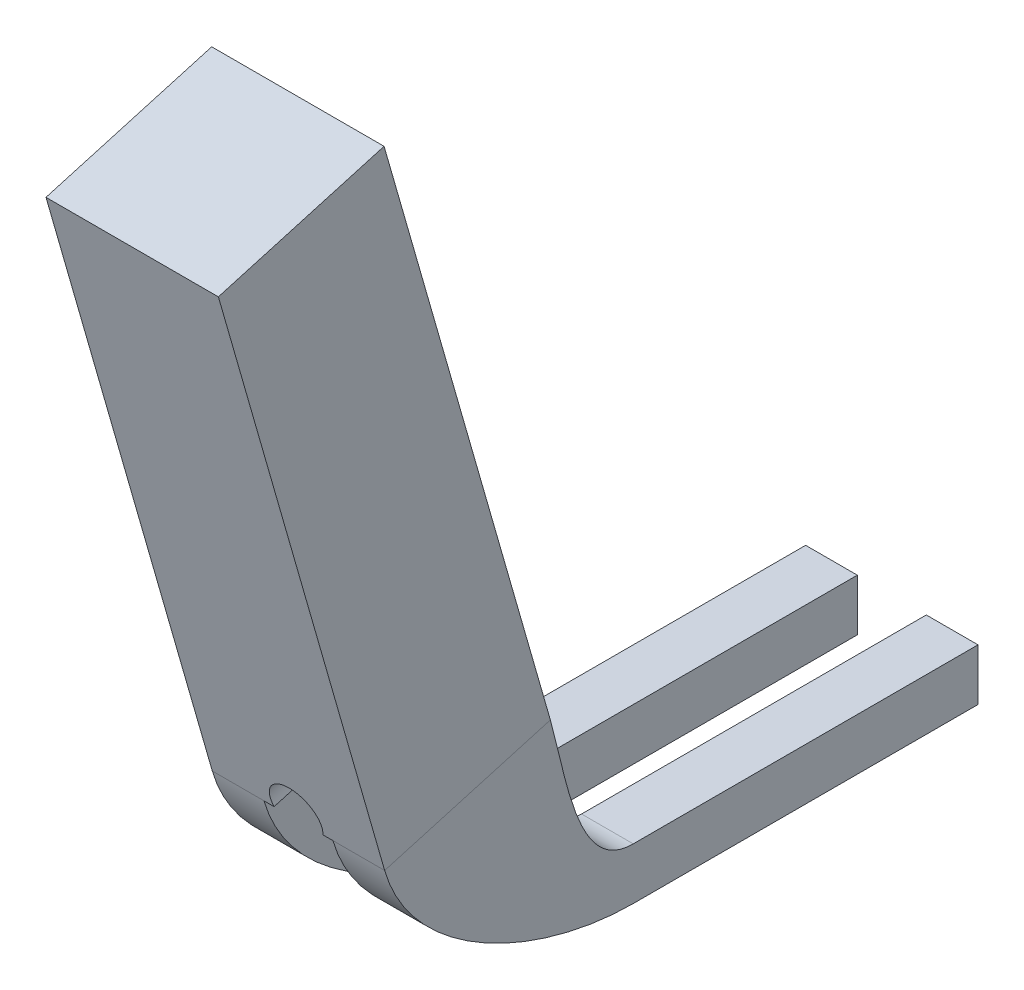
ISO-10303-21;
HEADER;
FILE_DESCRIPTION(('STEP AP214'),'2;1');
FILE_NAME('part.step','',(''),(''),'','','');
FILE_SCHEMA(('AUTOMOTIVE_DESIGN { 1 0 10303 214 1 1 1 1 }'));
ENDSEC;
DATA;
#1=APPLICATION_CONTEXT('core data for automotive mechanical design processes');
#2=APPLICATION_PROTOCOL_DEFINITION('international standard','automotive_design',2000,#1);
#3=PRODUCT_CONTEXT('',#1,'mechanical');
#4=PRODUCT('Part','Part','',(#3));
#5=PRODUCT_RELATED_PRODUCT_CATEGORY('part','',(#4));
#6=PRODUCT_DEFINITION_FORMATION('','',#4);
#7=PRODUCT_DEFINITION_CONTEXT('part definition',#1,'design');
#8=PRODUCT_DEFINITION('design','',#6,#7);
#9=PRODUCT_DEFINITION_SHAPE('','',#8);
#10=(LENGTH_UNIT() NAMED_UNIT(*) SI_UNIT(.MILLI.,.METRE.));
#11=(NAMED_UNIT(*) PLANE_ANGLE_UNIT() SI_UNIT($,.RADIAN.));
#12=(NAMED_UNIT(*) SI_UNIT($,.STERADIAN.) SOLID_ANGLE_UNIT());
#13=UNCERTAINTY_MEASURE_WITH_UNIT(LENGTH_MEASURE(1.E-05),#10,'distance_accuracy_value','');
#14=(GEOMETRIC_REPRESENTATION_CONTEXT(3) GLOBAL_UNCERTAINTY_ASSIGNED_CONTEXT((#13)) GLOBAL_UNIT_ASSIGNED_CONTEXT((#10,
#11,#12)) REPRESENTATION_CONTEXT('',''));
#15=CARTESIAN_POINT('',(0.,0.,0.));
#16=DIRECTION('',(0.,0.,1.));
#17=DIRECTION('',(1.,0.,0.));
#18=AXIS2_PLACEMENT_3D('',#15,#16,#17);
#19=CARTESIAN_POINT('',(1043.74743019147,5.45279363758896,394.108653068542));
#20=DIRECTION('',(1.,0.,0.));
#21=DIRECTION('',(0.,1.,0.));
#22=AXIS2_PLACEMENT_3D('',#19,#20,#21);
#23=PLANE('',#22);
#24=CARTESIAN_POINT('',(1043.74743019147,5.45279363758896,394.108653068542));
#25=CARTESIAN_POINT('',(1043.74743019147,5.45279363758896,399.842883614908));
#26=CARTESIAN_POINT('',(1043.74743501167,8.95515999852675,407.179825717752));
#27=CARTESIAN_POINT('',(1043.74743019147,14.4672733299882,408.760334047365));
#28=B_SPLINE_CURVE_WITH_KNOTS('',3,(#24,#25,#26,#27),.UNSPECIFIED.,.F.,.F.,(4,4),(0.,1.),.UNSPECIFIED.);
#29=CARTESIAN_POINT('',(1043.74743019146,14.4672792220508,408.760335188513));
#30=VERTEX_POINT('',#29);
#31=CARTESIAN_POINT('',(1043.74743019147,5.45279363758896,394.108653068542));
#32=VERTEX_POINT('',#31);
#33=EDGE_CURVE('E291',#30,#32,#28,.F.);
#34=ORIENTED_EDGE('',*,*,#33,.T.);
#35=DIRECTION('',(0.,0.,1.));
#36=VECTOR('',#35,1.);
#37=CARTESIAN_POINT('',(1043.74743019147,5.45279363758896,373.788653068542));
#38=LINE('',#37,#36);
#39=CARTESIAN_POINT('',(1043.74743019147,5.45279363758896,373.788653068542));
#40=VERTEX_POINT('',#39);
#41=EDGE_CURVE('E306',#40,#32,#38,.T.);
#42=ORIENTED_EDGE('',*,*,#41,.F.);
#43=DIRECTION('',(0.,-1.,0.));
#44=VECTOR('',#43,1.);
#45=CARTESIAN_POINT('',(1043.74743019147,8.50079363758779,373.788653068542));
#46=LINE('',#45,#44);
#47=CARTESIAN_POINT('',(1043.74743019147,8.50079363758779,373.788653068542));
#48=VERTEX_POINT('',#47);
#49=EDGE_CURVE('E220',#48,#40,#46,.T.);
#50=ORIENTED_EDGE('',*,*,#49,.F.);
#51=DIRECTION('',(0.,0.,1.));
#52=VECTOR('',#51,1.);
#53=CARTESIAN_POINT('',(1043.74743019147,8.50079363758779,373.788653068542));
#54=LINE('',#53,#52);
#55=CARTESIAN_POINT('',(1043.74743019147,8.50079363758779,394.108653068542));
#56=VERTEX_POINT('',#55);
#57=EDGE_CURVE('E234',#48,#56,#54,.T.);
#58=ORIENTED_EDGE('',*,*,#57,.T.);
#59=CARTESIAN_POINT('',(1043.74743019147,8.50079363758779,394.108653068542));
#60=CARTESIAN_POINT('',(1043.74743019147,8.50079363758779,397.454016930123));
#61=CARTESIAN_POINT('',(1043.74743300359,14.0518627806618,398.071812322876));
#62=CARTESIAN_POINT('',(1043.74743019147,17.2676429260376,398.993884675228));
#63=B_SPLINE_CURVE_WITH_KNOTS('',3,(#59,#60,#61,#62),.UNSPECIFIED.,.F.,.F.,(4,4),(0.,1.),.UNSPECIFIED.);
#64=CARTESIAN_POINT('',(1043.7474296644,17.2676487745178,398.993885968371));
#65=VERTEX_POINT('',#64);
#66=EDGE_CURVE('E246',#56,#65,#63,.T.);
#67=ORIENTED_EDGE('',*,*,#66,.T.);
#68=DIRECTION('',(-5.18765258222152E-08,0.275626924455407,-0.961264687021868));
#69=VECTOR('',#68,1.);
#70=CARTESIAN_POINT('',(1043.74741001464,121.669438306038,34.8866648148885));
#71=LINE('',#70,#69);
#72=EDGE_CURVE('E574',#30,#65,#71,.T.);
#73=ORIENTED_EDGE('',*,*,#72,.F.);
#74=EDGE_LOOP('',(#34,#42,#50,#58,#67,#73));
#75=FACE_BOUND('',#74,.T.);
#76=ADVANCED_FACE('F47',(#75),#23,.T.);
#77=CARTESIAN_POINT('',(1043.74743019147,8.50079363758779,394.108653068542));
#78=CARTESIAN_POINT('',(1043.74743019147,8.50079363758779,397.454016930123));
#79=CARTESIAN_POINT('',(1043.74743300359,14.0518627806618,398.071812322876));
#80=CARTESIAN_POINT('',(1043.74743019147,17.2676429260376,398.993884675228));
#81=CARTESIAN_POINT('',(1042.73143019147,8.50079363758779,394.108653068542));
#82=CARTESIAN_POINT('',(1042.73143019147,8.50079363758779,397.454016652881));
#83=CARTESIAN_POINT('',(1042.73143300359,14.0518622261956,398.071812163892));
#84=CARTESIAN_POINT('',(1042.73143019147,17.2676421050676,398.993884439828));
#85=CARTESIAN_POINT('',(1041.71543019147,8.50079363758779,394.108653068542));
#86=CARTESIAN_POINT('',(1041.71543019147,8.50079363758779,397.454016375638));
#87=CARTESIAN_POINT('',(1041.71543300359,14.0518616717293,398.071812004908));
#88=CARTESIAN_POINT('',(1041.71543019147,17.2676412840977,398.993884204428));
#89=CARTESIAN_POINT('',(1040.69943019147,8.50079363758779,394.108653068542));
#90=CARTESIAN_POINT('',(1040.69943019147,8.50079363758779,397.454016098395));
#91=CARTESIAN_POINT('',(1040.69943300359,14.0518611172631,398.071811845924));
#92=CARTESIAN_POINT('',(1040.69943019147,17.2676404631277,398.993883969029));
#93=B_SPLINE_SURFACE_WITH_KNOTS('',3,3,((#77,#78,#79,#80),(#81,#82,#83,#84),(#85,#86,#87,#88),
(#89,#90,#91,#92)),.UNSPECIFIED.,.F.,.F.,.F.,(4,4),(4,4),(0.,1.),(0.,1.),.UNSPECIFIED.);
#94=DIRECTION('',(1.,0.,0.));
#95=VECTOR('',#94,1.);
#96=CARTESIAN_POINT('',(1043.74743019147,8.50079363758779,394.108653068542));
#97=LINE('',#96,#95);
#98=CARTESIAN_POINT('',(1040.69943019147,8.50079363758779,394.108653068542));
#99=VERTEX_POINT('',#98);
#100=EDGE_CURVE('E240',#99,#56,#97,.T.);
#101=CARTESIAN_POINT('',(1040.69943019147,8.50079363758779,394.108653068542));
#102=CARTESIAN_POINT('',(1040.69943019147,8.50079363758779,397.454016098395));
#103=CARTESIAN_POINT('',(1040.69943300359,14.0518611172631,398.071811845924));
#104=CARTESIAN_POINT('',(1040.69943019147,17.2676404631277,398.993883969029));
#105=B_SPLINE_CURVE_WITH_KNOTS('',3,(#101,#102,#103,#104),.UNSPECIFIED.,.F.,.F.,(4,4),(0.,1.),.UNSPECIFIED.);
#106=CARTESIAN_POINT('',(1040.69943019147,17.2676462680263,398.993885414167));
#107=VERTEX_POINT('',#106);
#108=EDGE_CURVE('E665',#99,#107,#105,.T.);
#109=DIRECTION('',(-0.999999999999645,-8.22339851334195E-07,-1.81825562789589E-07));
#110=VECTOR('',#109,1.);
#111=CARTESIAN_POINT('',(-8.6746423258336E-05,17.2667904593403,398.993696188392));
#112=LINE('',#111,#110);
#113=EDGE_CURVE('E51',#65,#107,#112,.T.);
#114=ORIENTED_EDGE('',*,*,#100,.F.);
#115=ORIENTED_EDGE('',*,*,#108,.T.);
#116=ORIENTED_EDGE('',*,*,#113,.F.);
#117=ORIENTED_EDGE('',*,*,#66,.F.);
#118=EDGE_LOOP('',(#114,#115,#116,#117));
#119=FACE_BOUND('',#118,.T.);
#120=ADVANCED_FACE('F248',(#119),#93,.T.);
#121=CARTESIAN_POINT('',(1040.69943019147,5.45279363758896,394.108653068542));
#122=CARTESIAN_POINT('',(1040.69943019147,5.45279363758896,399.842882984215));
#123=CARTESIAN_POINT('',(1040.69943501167,8.95515814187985,407.179825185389));
#124=CARTESIAN_POINT('',(1040.69943019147,14.4672708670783,408.760333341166));
#125=CARTESIAN_POINT('',(1041.71543019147,5.45279363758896,394.108653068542));
#126=CARTESIAN_POINT('',(1041.71543019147,5.45279363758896,399.842883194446));
#127=CARTESIAN_POINT('',(1041.71543501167,8.95515876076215,407.179825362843));
#128=CARTESIAN_POINT('',(1041.71543019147,14.4672716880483,408.760333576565));
#129=CARTESIAN_POINT('',(1042.73143019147,5.45279363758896,394.108653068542));
#130=CARTESIAN_POINT('',(1042.73143019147,5.45279363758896,399.842883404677));
#131=CARTESIAN_POINT('',(1042.73143501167,8.95515937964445,407.179825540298));
#132=CARTESIAN_POINT('',(1042.73143019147,14.4672725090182,408.760333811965));
#133=CARTESIAN_POINT('',(1043.74743019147,5.45279363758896,394.108653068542));
#134=CARTESIAN_POINT('',(1043.74743019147,5.45279363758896,399.842883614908));
#135=CARTESIAN_POINT('',(1043.74743501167,8.95515999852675,407.179825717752));
#136=CARTESIAN_POINT('',(1043.74743019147,14.4672733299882,408.760334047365));
#137=B_SPLINE_SURFACE_WITH_KNOTS('',3,3,((#121,#122,#123,#124),(#125,#126,#127,#128),(#129,#130,
#131,#132),(#133,#134,#135,#136)),.UNSPECIFIED.,.F.,.F.,.F.,(4,4),(4,4),(0.,1.),(0.,1.),.UNSPECIFIED.);
#138=DIRECTION('',(-1.,0.,0.));
#139=VECTOR('',#138,1.);
#140=CARTESIAN_POINT('',(1043.74743019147,5.45279363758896,394.108653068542));
#141=LINE('',#140,#139);
#142=CARTESIAN_POINT('',(1040.69943019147,5.45279363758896,394.108653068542));
#143=VERTEX_POINT('',#142);
#144=EDGE_CURVE('E292',#32,#143,#141,.T.);
#145=DIRECTION('',(-0.999999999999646,-8.22339851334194E-07,-1.81825562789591E-07));
#146=VECTOR('',#145,1.);
#147=CARTESIAN_POINT('',(-8.62193579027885E-05,14.4664209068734,408.760145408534));
#148=LINE('',#147,#146);
#149=CARTESIAN_POINT('',(1040.69943019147,14.4672708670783,408.760333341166));
#150=VERTEX_POINT('',#149);
#151=EDGE_CURVE('E168',#30,#150,#148,.T.);
#152=CARTESIAN_POINT('',(1040.69943019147,5.45279363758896,394.108653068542));
#153=CARTESIAN_POINT('',(1040.69943019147,5.45279363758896,399.842882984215));
#154=CARTESIAN_POINT('',(1040.69943501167,8.95515814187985,407.179825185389));
#155=CARTESIAN_POINT('',(1040.69943019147,14.4672708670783,408.760333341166));
#156=B_SPLINE_CURVE_WITH_KNOTS('',3,(#152,#153,#154,#155),.UNSPECIFIED.,.F.,.F.,(4,4),(0.,1.),.UNSPECIFIED.);
#157=EDGE_CURVE('E58',#143,#150,#156,.T.);
#158=ORIENTED_EDGE('',*,*,#144,.F.);
#159=ORIENTED_EDGE('',*,*,#33,.F.);
#160=ORIENTED_EDGE('',*,*,#151,.T.);
#161=ORIENTED_EDGE('',*,*,#157,.F.);
#162=EDGE_LOOP('',(#158,#159,#160,#161));
#163=FACE_BOUND('',#162,.T.);
#164=ADVANCED_FACE('F259',(#163),#137,.T.);
#165=CARTESIAN_POINT('',(1040.69943019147,8.50079363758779,394.108653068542));
#166=DIRECTION('',(-1.,0.,0.));
#167=DIRECTION('',(0.,-1.,0.));
#168=AXIS2_PLACEMENT_3D('',#165,#166,#167);
#169=PLANE('',#168);
#170=ORIENTED_EDGE('',*,*,#108,.F.);
#171=DIRECTION('',(0.,0.,1.));
#172=VECTOR('',#171,1.);
#173=CARTESIAN_POINT('',(1040.69943019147,8.50079363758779,373.788653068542));
#174=LINE('',#173,#172);
#175=CARTESIAN_POINT('',(1040.69943019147,8.50079363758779,373.788653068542));
#176=VERTEX_POINT('',#175);
#177=EDGE_CURVE('E297',#176,#99,#174,.T.);
#178=ORIENTED_EDGE('',*,*,#177,.F.);
#179=DIRECTION('',(0.,1.,0.));
#180=VECTOR('',#179,1.);
#181=CARTESIAN_POINT('',(1040.69943019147,8.50079363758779,373.788653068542));
#182=LINE('',#181,#180);
#183=CARTESIAN_POINT('',(1040.69943019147,5.45279363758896,373.788653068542));
#184=VERTEX_POINT('',#183);
#185=EDGE_CURVE('E228',#184,#176,#182,.T.);
#186=ORIENTED_EDGE('',*,*,#185,.F.);
#187=DIRECTION('',(0.,0.,1.));
#188=VECTOR('',#187,1.);
#189=CARTESIAN_POINT('',(1040.69943019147,5.45279363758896,373.788653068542));
#190=LINE('',#189,#188);
#191=EDGE_CURVE('E300',#184,#143,#190,.T.);
#192=ORIENTED_EDGE('',*,*,#191,.T.);
#193=ORIENTED_EDGE('',*,*,#157,.T.);
#194=DIRECTION('',(0.,0.27562692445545,-0.961264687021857));
#195=VECTOR('',#194,1.);
#196=CARTESIAN_POINT('',(1040.69943019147,14.4672708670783,408.760333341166));
#197=LINE('',#196,#195);
#198=EDGE_CURVE('E11',#150,#107,#197,.T.);
#199=ORIENTED_EDGE('',*,*,#198,.T.);
#200=EDGE_LOOP('',(#170,#178,#186,#192,#193,#199));
#201=FACE_BOUND('',#200,.T.);
#202=ADVANCED_FACE('F49',(#201),#169,.T.);
#203=CARTESIAN_POINT('',(1043.74743019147,5.45279363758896,373.788653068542));
#204=DIRECTION('',(0.,1.,0.));
#205=DIRECTION('',(0.,0.,1.));
#206=AXIS2_PLACEMENT_3D('',#203,#204,#205);
#207=PLANE('',#206);
#208=ORIENTED_EDGE('',*,*,#144,.T.);
#209=ORIENTED_EDGE('',*,*,#191,.F.);
#210=DIRECTION('',(-1.,0.,0.));
#211=VECTOR('',#210,1.);
#212=CARTESIAN_POINT('',(1043.74743019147,5.45279363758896,373.788653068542));
#213=LINE('',#212,#211);
#214=EDGE_CURVE('E224',#40,#184,#213,.T.);
#215=ORIENTED_EDGE('',*,*,#214,.F.);
#216=ORIENTED_EDGE('',*,*,#41,.T.);
#217=EDGE_LOOP('',(#208,#209,#215,#216));
#218=FACE_BOUND('',#217,.T.);
#219=ADVANCED_FACE('F317',(#218),#207,.F.);
#220=CARTESIAN_POINT('',(1043.74743019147,8.50079363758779,373.788653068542));
#221=DIRECTION('',(0.,-1.,0.));
#222=DIRECTION('',(0.,0.,-1.));
#223=AXIS2_PLACEMENT_3D('',#220,#221,#222);
#224=PLANE('',#223);
#225=ORIENTED_EDGE('',*,*,#100,.T.);
#226=ORIENTED_EDGE('',*,*,#57,.F.);
#227=DIRECTION('',(1.,0.,0.));
#228=VECTOR('',#227,1.);
#229=CARTESIAN_POINT('',(1043.74743019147,8.50079363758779,373.788653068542));
#230=LINE('',#229,#228);
#231=EDGE_CURVE('E231',#176,#48,#230,.T.);
#232=ORIENTED_EDGE('',*,*,#231,.F.);
#233=ORIENTED_EDGE('',*,*,#177,.T.);
#234=EDGE_LOOP('',(#225,#226,#232,#233));
#235=FACE_BOUND('',#234,.T.);
#236=ADVANCED_FACE('F325',(#235),#224,.F.);
#237=CARTESIAN_POINT('',(7.112,0.,373.788653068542));
#238=DIRECTION('',(0.,0.,-1.));
#239=DIRECTION('',(-1.,0.,0.));
#240=AXIS2_PLACEMENT_3D('',#237,#238,#239);
#241=PLANE('',#240);
#242=ORIENTED_EDGE('',*,*,#49,.T.);
#243=ORIENTED_EDGE('',*,*,#214,.T.);
#244=ORIENTED_EDGE('',*,*,#185,.T.);
#245=ORIENTED_EDGE('',*,*,#231,.T.);
#246=EDGE_LOOP('',(#242,#243,#244,#245));
#247=FACE_BOUND('',#246,.T.);
#248=ADVANCED_FACE('F329',(#247),#241,.T.);
#249=CARTESIAN_POINT('',(-0.000106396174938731,121.668579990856,34.8864750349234));
#250=DIRECTION('',(-8.40602280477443E-07,0.961264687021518,0.275626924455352));
#251=DIRECTION('',(0.,-0.27562692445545,0.961264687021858));
#252=AXIS2_PLACEMENT_3D('',#249,#250,#251);
#253=PLANE('',#252);
#254=CARTESIAN_POINT('',(1040.10426956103,17.267645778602,398.993885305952));
#255=VERTEX_POINT('',#254);
#256=EDGE_CURVE('E218',#107,#255,#112,.T.);
#257=ORIENTED_EDGE('',*,*,#256,.F.);
#258=ORIENTED_EDGE('',*,*,#198,.F.);
#259=CARTESIAN_POINT('',(1040.10427008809,14.467276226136,408.76033452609));
#260=VERTEX_POINT('',#259);
#261=EDGE_CURVE('E66',#150,#260,#148,.T.);
#262=ORIENTED_EDGE('',*,*,#261,.T.);
#263=DIRECTION('',(5.18765149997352E-08,-0.275626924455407,0.961264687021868));
#264=VECTOR('',#263,1.);
#265=CARTESIAN_POINT('',(1040.10426937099,18.2773342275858,395.472539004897));
#266=LINE('',#265,#264);
#267=EDGE_CURVE('E166',#255,#260,#266,.T.);
#268=ORIENTED_EDGE('',*,*,#267,.F.);
#269=EDGE_LOOP('',(#257,#258,#262,#268));
#270=FACE_BOUND('',#269,.T.);
#271=ADVANCED_FACE('F165',(#270),#253,.F.);
#272=CARTESIAN_POINT('',(1036.63543019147,5.45279363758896,394.108653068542));
#273=DIRECTION('',(1.,0.,0.));
#274=DIRECTION('',(0.,1.,0.));
#275=AXIS2_PLACEMENT_3D('',#272,#273,#274);
#276=PLANE('',#275);
#277=CARTESIAN_POINT('',(1036.63543019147,5.45279363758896,394.108653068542));
#278=CARTESIAN_POINT('',(1036.63543019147,5.45279363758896,399.842883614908));
#279=CARTESIAN_POINT('',(1036.63543501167,8.95515999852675,407.179825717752));
#280=CARTESIAN_POINT('',(1036.63543019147,14.4672733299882,408.760334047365));
#281=B_SPLINE_CURVE_WITH_KNOTS('',3,(#277,#278,#279,#280),.UNSPECIFIED.,.F.,.F.,(4,4),(0.,1.),.UNSPECIFIED.);
#282=CARTESIAN_POINT('',(1036.63543019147,14.4672733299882,408.760334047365));
#283=VERTEX_POINT('',#282);
#284=CARTESIAN_POINT('',(1036.63543019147,5.45279363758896,394.108653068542));
#285=VERTEX_POINT('',#284);
#286=EDGE_CURVE('E367',#283,#285,#281,.F.);
#287=ORIENTED_EDGE('',*,*,#286,.T.);
#288=DIRECTION('',(0.,0.,1.));
#289=VECTOR('',#288,1.);
#290=CARTESIAN_POINT('',(1036.63543019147,5.45279363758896,373.788653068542));
#291=LINE('',#290,#289);
#292=CARTESIAN_POINT('',(1036.63543019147,5.45279363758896,373.788653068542));
#293=VERTEX_POINT('',#292);
#294=EDGE_CURVE('E384',#293,#285,#291,.T.);
#295=ORIENTED_EDGE('',*,*,#294,.F.);
#296=DIRECTION('',(0.,-1.,0.));
#297=VECTOR('',#296,1.);
#298=CARTESIAN_POINT('',(1036.63543019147,8.50079363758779,373.788653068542));
#299=LINE('',#298,#297);
#300=CARTESIAN_POINT('',(1036.63543019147,8.50079363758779,373.788653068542));
#301=VERTEX_POINT('',#300);
#302=EDGE_CURVE('E628',#301,#293,#299,.T.);
#303=ORIENTED_EDGE('',*,*,#302,.F.);
#304=DIRECTION('',(0.,0.,1.));
#305=VECTOR('',#304,1.);
#306=CARTESIAN_POINT('',(1036.63543019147,8.50079363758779,373.788653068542));
#307=LINE('',#306,#305);
#308=CARTESIAN_POINT('',(1036.63543019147,8.50079363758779,394.108653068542));
#309=VERTEX_POINT('',#308);
#310=EDGE_CURVE('E378',#301,#309,#307,.T.);
#311=ORIENTED_EDGE('',*,*,#310,.T.);
#312=CARTESIAN_POINT('',(1036.63543019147,8.50079363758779,394.108653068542));
#313=CARTESIAN_POINT('',(1036.63543019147,8.50079363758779,397.454016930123));
#314=CARTESIAN_POINT('',(1036.63543300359,14.0518627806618,398.071812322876));
#315=CARTESIAN_POINT('',(1036.63543019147,17.2676429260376,398.993884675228));
#316=B_SPLINE_CURVE_WITH_KNOTS('',3,(#312,#313,#314,#315),.UNSPECIFIED.,.F.,.F.,(4,4),(0.,1.),.UNSPECIFIED.);
#317=CARTESIAN_POINT('',(1036.63543019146,17.2676429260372,398.993884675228));
#318=VERTEX_POINT('',#317);
#319=EDGE_CURVE('E463',#309,#318,#316,.T.);
#320=ORIENTED_EDGE('',*,*,#319,.T.);
#321=DIRECTION('',(0.,-0.27562692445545,0.961264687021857));
#322=VECTOR('',#321,1.);
#323=CARTESIAN_POINT('',(1036.63543019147,14.4672733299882,408.760334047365));
#324=LINE('',#323,#322);
#325=EDGE_CURVE('E507',#318,#283,#324,.T.);
#326=ORIENTED_EDGE('',*,*,#325,.T.);
#327=EDGE_LOOP('',(#287,#295,#303,#311,#320,#326));
#328=FACE_BOUND('',#327,.T.);
#329=ADVANCED_FACE('F408',(#328),#276,.T.);
#330=CARTESIAN_POINT('',(1036.63543019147,8.50079363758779,394.108653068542));
#331=CARTESIAN_POINT('',(1036.63543019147,8.50079363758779,397.454016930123));
#332=CARTESIAN_POINT('',(1036.63543300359,14.0518627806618,398.071812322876));
#333=CARTESIAN_POINT('',(1036.63543019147,17.2676429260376,398.993884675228));
#334=CARTESIAN_POINT('',(1035.61943019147,8.50079363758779,394.108653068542));
#335=CARTESIAN_POINT('',(1035.61943019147,8.50079363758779,397.454016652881));
#336=CARTESIAN_POINT('',(1035.61943300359,14.0518622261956,398.071812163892));
#337=CARTESIAN_POINT('',(1035.61943019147,17.2676421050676,398.993884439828));
#338=CARTESIAN_POINT('',(1034.60343019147,8.50079363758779,394.108653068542));
#339=CARTESIAN_POINT('',(1034.60343019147,8.50079363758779,397.454016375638));
#340=CARTESIAN_POINT('',(1034.60343300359,14.0518616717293,398.071812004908));
#341=CARTESIAN_POINT('',(1034.60343019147,17.2676412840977,398.993884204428));
#342=CARTESIAN_POINT('',(1033.58743019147,8.50079363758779,394.108653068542));
#343=CARTESIAN_POINT('',(1033.58743019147,8.50079363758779,397.454016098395));
#344=CARTESIAN_POINT('',(1033.58743300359,14.0518611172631,398.071811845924));
#345=CARTESIAN_POINT('',(1033.58743019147,17.2676404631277,398.993883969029));
#346=B_SPLINE_SURFACE_WITH_KNOTS('',3,3,((#330,#331,#332,#333),(#334,#335,#336,#337),(#338,#339,
#340,#341),(#342,#343,#344,#345)),.UNSPECIFIED.,.F.,.F.,.F.,(4,4),(4,4),(0.,1.),(0.,1.),.UNSPECIFIED.);
#347=DIRECTION('',(1.,0.,0.));
#348=VECTOR('',#347,1.);
#349=CARTESIAN_POINT('',(1036.63543019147,8.50079363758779,394.108653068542));
#350=LINE('',#349,#348);
#351=CARTESIAN_POINT('',(1033.58743019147,8.50079363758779,394.108653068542));
#352=VERTEX_POINT('',#351);
#353=EDGE_CURVE('E362',#352,#309,#350,.T.);
#354=CARTESIAN_POINT('',(1033.58743019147,8.50079363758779,394.108653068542));
#355=CARTESIAN_POINT('',(1033.58743019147,8.50079363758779,397.454016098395));
#356=CARTESIAN_POINT('',(1033.58743300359,14.0518611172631,398.071811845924));
#357=CARTESIAN_POINT('',(1033.58743019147,17.2676404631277,398.993883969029));
#358=B_SPLINE_CURVE_WITH_KNOTS('',3,(#354,#355,#356,#357),.UNSPECIFIED.,.F.,.F.,(4,4),(0.,1.),.UNSPECIFIED.);
#359=CARTESIAN_POINT('',(1033.5874296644,17.2676404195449,398.993884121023));
#360=VERTEX_POINT('',#359);
#361=EDGE_CURVE('E485',#352,#360,#358,.T.);
#362=DIRECTION('',(0.999999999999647,8.08041288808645E-07,2.31692617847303E-07));
#363=VECTOR('',#362,1.);
#364=CARTESIAN_POINT('',(1033.58743019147,17.2676404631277,398.993883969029));
#365=LINE('',#364,#363);
#366=EDGE_CURVE('E439',#360,#318,#365,.T.);
#367=ORIENTED_EDGE('',*,*,#353,.F.);
#368=ORIENTED_EDGE('',*,*,#361,.T.);
#369=ORIENTED_EDGE('',*,*,#366,.T.);
#370=ORIENTED_EDGE('',*,*,#319,.F.);
#371=EDGE_LOOP('',(#367,#368,#369,#370));
#372=FACE_BOUND('',#371,.T.);
#373=ADVANCED_FACE('F410',(#372),#346,.T.);
#374=CARTESIAN_POINT('',(1033.58743019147,5.45279363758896,394.108653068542));
#375=CARTESIAN_POINT('',(1033.58743019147,5.45279363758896,399.842882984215));
#376=CARTESIAN_POINT('',(1033.58743501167,8.95515814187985,407.179825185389));
#377=CARTESIAN_POINT('',(1033.58743019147,14.4672708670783,408.760333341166));
#378=CARTESIAN_POINT('',(1034.60343019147,5.45279363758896,394.108653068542));
#379=CARTESIAN_POINT('',(1034.60343019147,5.45279363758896,399.842883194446));
#380=CARTESIAN_POINT('',(1034.60343501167,8.95515876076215,407.179825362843));
#381=CARTESIAN_POINT('',(1034.60343019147,14.4672716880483,408.760333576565));
#382=CARTESIAN_POINT('',(1035.61943019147,5.45279363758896,394.108653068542));
#383=CARTESIAN_POINT('',(1035.61943019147,5.45279363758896,399.842883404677));
#384=CARTESIAN_POINT('',(1035.61943501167,8.95515937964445,407.179825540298));
#385=CARTESIAN_POINT('',(1035.61943019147,14.4672725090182,408.760333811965));
#386=CARTESIAN_POINT('',(1036.63543019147,5.45279363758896,394.108653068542));
#387=CARTESIAN_POINT('',(1036.63543019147,5.45279363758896,399.842883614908));
#388=CARTESIAN_POINT('',(1036.63543501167,8.95515999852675,407.179825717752));
#389=CARTESIAN_POINT('',(1036.63543019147,14.4672733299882,408.760334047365));
#390=B_SPLINE_SURFACE_WITH_KNOTS('',3,3,((#374,#375,#376,#377),(#378,#379,#380,#381),(#382,#383,
#384,#385),(#386,#387,#388,#389)),.UNSPECIFIED.,.F.,.F.,.F.,(4,4),(4,4),(0.,1.),(0.,1.),.UNSPECIFIED.);
#391=DIRECTION('',(-1.,0.,0.));
#392=VECTOR('',#391,1.);
#393=CARTESIAN_POINT('',(1036.63543019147,5.45279363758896,394.108653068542));
#394=LINE('',#393,#392);
#395=CARTESIAN_POINT('',(1033.58743019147,5.45279363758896,394.108653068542));
#396=VERTEX_POINT('',#395);
#397=EDGE_CURVE('E368',#285,#396,#394,.T.);
#398=DIRECTION('',(-0.999999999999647,-8.08041288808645E-07,-2.31692617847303E-07));
#399=VECTOR('',#398,1.);
#400=CARTESIAN_POINT('',(1033.58743019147,14.4672708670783,408.760333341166));
#401=LINE('',#400,#399);
#402=CARTESIAN_POINT('',(1033.58743019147,14.467270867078,408.760333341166));
#403=VERTEX_POINT('',#402);
#404=EDGE_CURVE('E225',#283,#403,#401,.T.);
#405=CARTESIAN_POINT('',(1033.58743019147,5.45279363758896,394.108653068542));
#406=CARTESIAN_POINT('',(1033.58743019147,5.45279363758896,399.842882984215));
#407=CARTESIAN_POINT('',(1033.58743501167,8.95515814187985,407.179825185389));
#408=CARTESIAN_POINT('',(1033.58743019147,14.4672708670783,408.760333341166));
#409=B_SPLINE_CURVE_WITH_KNOTS('',3,(#405,#406,#407,#408),.UNSPECIFIED.,.F.,.F.,(4,4),(0.,1.),.UNSPECIFIED.);
#410=EDGE_CURVE('E477',#396,#403,#409,.T.);
#411=ORIENTED_EDGE('',*,*,#397,.F.);
#412=ORIENTED_EDGE('',*,*,#286,.F.);
#413=ORIENTED_EDGE('',*,*,#404,.T.);
#414=ORIENTED_EDGE('',*,*,#410,.F.);
#415=EDGE_LOOP('',(#411,#412,#413,#414));
#416=FACE_BOUND('',#415,.T.);
#417=ADVANCED_FACE('F339',(#416),#390,.T.);
#418=CARTESIAN_POINT('',(1033.58743019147,8.50079363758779,394.108653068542));
#419=DIRECTION('',(-1.,0.,0.));
#420=DIRECTION('',(0.,-1.,0.));
#421=AXIS2_PLACEMENT_3D('',#418,#419,#420);
#422=PLANE('',#421);
#423=ORIENTED_EDGE('',*,*,#361,.F.);
#424=DIRECTION('',(0.,0.,1.));
#425=VECTOR('',#424,1.);
#426=CARTESIAN_POINT('',(1033.58743019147,8.50079363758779,373.788653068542));
#427=LINE('',#426,#425);
#428=CARTESIAN_POINT('',(1033.58743019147,8.50079363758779,373.788653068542));
#429=VERTEX_POINT('',#428);
#430=EDGE_CURVE('E373',#429,#352,#427,.T.);
#431=ORIENTED_EDGE('',*,*,#430,.F.);
#432=DIRECTION('',(0.,1.,0.));
#433=VECTOR('',#432,1.);
#434=CARTESIAN_POINT('',(1033.58743019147,8.50079363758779,373.788653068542));
#435=LINE('',#434,#433);
#436=CARTESIAN_POINT('',(1033.58743019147,5.45279363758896,373.788653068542));
#437=VERTEX_POINT('',#436);
#438=EDGE_CURVE('E687',#437,#429,#435,.T.);
#439=ORIENTED_EDGE('',*,*,#438,.F.);
#440=DIRECTION('',(0.,0.,1.));
#441=VECTOR('',#440,1.);
#442=CARTESIAN_POINT('',(1033.58743019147,5.45279363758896,373.788653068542));
#443=LINE('',#442,#441);
#444=EDGE_CURVE('E377',#437,#396,#443,.T.);
#445=ORIENTED_EDGE('',*,*,#444,.T.);
#446=ORIENTED_EDGE('',*,*,#410,.T.);
#447=DIRECTION('',(0.,0.27562692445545,-0.961264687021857));
#448=VECTOR('',#447,1.);
#449=CARTESIAN_POINT('',(1033.58743019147,14.4672708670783,408.760333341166));
#450=LINE('',#449,#448);
#451=EDGE_CURVE('E484',#403,#360,#450,.T.);
#452=ORIENTED_EDGE('',*,*,#451,.T.);
#453=EDGE_LOOP('',(#423,#431,#439,#445,#446,#452));
#454=FACE_BOUND('',#453,.T.);
#455=ADVANCED_FACE('F334',(#454),#422,.T.);
#456=CARTESIAN_POINT('',(1036.63543019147,5.45279363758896,373.788653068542));
#457=DIRECTION('',(0.,1.,0.));
#458=DIRECTION('',(0.,0.,1.));
#459=AXIS2_PLACEMENT_3D('',#456,#457,#458);
#460=PLANE('',#459);
#461=ORIENTED_EDGE('',*,*,#397,.T.);
#462=ORIENTED_EDGE('',*,*,#444,.F.);
#463=DIRECTION('',(-1.,0.,0.));
#464=VECTOR('',#463,1.);
#465=CARTESIAN_POINT('',(1036.63543019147,5.45279363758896,373.788653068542));
#466=LINE('',#465,#464);
#467=EDGE_CURVE('E683',#293,#437,#466,.T.);
#468=ORIENTED_EDGE('',*,*,#467,.F.);
#469=ORIENTED_EDGE('',*,*,#294,.T.);
#470=EDGE_LOOP('',(#461,#462,#468,#469));
#471=FACE_BOUND('',#470,.T.);
#472=ADVANCED_FACE('F338',(#471),#460,.F.);
#473=CARTESIAN_POINT('',(1036.63543019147,8.50079363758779,373.788653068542));
#474=DIRECTION('',(0.,-1.,0.));
#475=DIRECTION('',(0.,0.,-1.));
#476=AXIS2_PLACEMENT_3D('',#473,#474,#475);
#477=PLANE('',#476);
#478=ORIENTED_EDGE('',*,*,#353,.T.);
#479=ORIENTED_EDGE('',*,*,#310,.F.);
#480=DIRECTION('',(1.,0.,0.));
#481=VECTOR('',#480,1.);
#482=CARTESIAN_POINT('',(1036.63543019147,8.50079363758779,373.788653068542));
#483=LINE('',#482,#481);
#484=EDGE_CURVE('E518',#429,#301,#483,.T.);
#485=ORIENTED_EDGE('',*,*,#484,.F.);
#486=ORIENTED_EDGE('',*,*,#430,.T.);
#487=EDGE_LOOP('',(#478,#479,#485,#486));
#488=FACE_BOUND('',#487,.T.);
#489=ADVANCED_FACE('F405',(#488),#477,.F.);
#490=CARTESIAN_POINT('',(0.,0.,373.788653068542));
#491=DIRECTION('',(0.,0.,-1.));
#492=DIRECTION('',(-1.,0.,0.));
#493=AXIS2_PLACEMENT_3D('',#490,#491,#492);
#494=PLANE('',#493);
#495=ORIENTED_EDGE('',*,*,#302,.T.);
#496=ORIENTED_EDGE('',*,*,#467,.T.);
#497=ORIENTED_EDGE('',*,*,#438,.T.);
#498=ORIENTED_EDGE('',*,*,#484,.T.);
#499=EDGE_LOOP('',(#495,#496,#497,#498));
#500=FACE_BOUND('',#499,.T.);
#501=ADVANCED_FACE('F695',(#500),#494,.T.);
#502=CARTESIAN_POINT('',(1037.2305911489,14.4672738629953,408.760334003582));
#503=VERTEX_POINT('',#502);
#504=EDGE_CURVE('E169',#503,#283,#148,.T.);
#505=ORIENTED_EDGE('',*,*,#504,.T.);
#506=ORIENTED_EDGE('',*,*,#325,.F.);
#507=CARTESIAN_POINT('',(1037.23059062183,17.2676434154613,398.993884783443));
#508=VERTEX_POINT('',#507);
#509=EDGE_CURVE('E578',#508,#318,#112,.T.);
#510=ORIENTED_EDGE('',*,*,#509,.F.);
#511=DIRECTION('',(5.18765149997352E-08,-0.275626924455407,0.961264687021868));
#512=VECTOR('',#511,1.);
#513=CARTESIAN_POINT('',(1037.23059043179,18.2773318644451,395.472538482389));
#514=LINE('',#513,#512);
#515=EDGE_CURVE('E179',#508,#503,#514,.T.);
#516=ORIENTED_EDGE('',*,*,#515,.T.);
#517=EDGE_LOOP('',(#505,#506,#510,#516));
#518=FACE_BOUND('',#517,.T.);
#519=ADVANCED_FACE('F697',(#518),#253,.F.);
#520=CARTESIAN_POINT('',(1033.58738012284,155.852002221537,44.6879564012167));
#521=DIRECTION('',(-0.999999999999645,-8.22339843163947E-07,-1.81825590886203E-07));
#522=DIRECTION('',(8.2233984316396E-07,-0.999999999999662,0.));
#523=AXIS2_PLACEMENT_3D('',#520,#521,#522);
#524=PLANE('',#523);
#525=ORIENTED_EDGE('',*,*,#451,.F.);
#526=DIRECTION('',(8.40602280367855E-07,-0.961264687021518,-0.275626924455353));
#527=VECTOR('',#526,1.);
#528=CARTESIAN_POINT('',(1033.58740029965,48.6498431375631,418.561626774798));
#529=LINE('',#528,#527);
#530=CARTESIAN_POINT('',(1033.58740029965,48.6498431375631,418.561626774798));
#531=VERTEX_POINT('',#530);
#532=EDGE_CURVE('E566',#531,#403,#529,.T.);
#533=ORIENTED_EDGE('',*,*,#532,.F.);
#534=DIRECTION('',(-5.18764821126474E-08,0.275626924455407,-0.961264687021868));
#535=VECTOR('',#534,1.);
#536=CARTESIAN_POINT('',(1033.58738012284,155.852002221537,44.6879564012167));
#537=LINE('',#536,#535);
#538=CARTESIAN_POINT('',(1033.58739977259,51.4502126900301,408.795177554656));
#539=VERTEX_POINT('',#538);
#540=EDGE_CURVE('E194',#531,#539,#537,.T.);
#541=ORIENTED_EDGE('',*,*,#540,.T.);
#542=DIRECTION('',(8.40602280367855E-07,-0.961264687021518,-0.275626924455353));
#543=VECTOR('',#542,1.);
#544=CARTESIAN_POINT('',(1033.58739977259,51.4502126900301,408.795177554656));
#545=LINE('',#544,#543);
#546=EDGE_CURVE('E208',#539,#360,#545,.T.);
#547=ORIENTED_EDGE('',*,*,#546,.T.);
#548=EDGE_LOOP('',(#525,#533,#541,#547));
#549=FACE_BOUND('',#548,.T.);
#550=ADVANCED_FACE('F548',(#549),#524,.T.);
#551=CARTESIAN_POINT('',(-0.000116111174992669,48.6489931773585,418.561438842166));
#552=DIRECTION('',(5.18765113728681E-08,-0.275626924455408,0.961264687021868));
#553=DIRECTION('',(0.,-0.96126468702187,-0.275626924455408));
#554=AXIS2_PLACEMENT_3D('',#551,#552,#553);
#555=PLANE('',#554);
#556=CARTESIAN_POINT('',(1038.66743019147,14.9556016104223,408.900353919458));
#557=DIRECTION('',(5.18765151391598E-08,-0.275626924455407,0.961264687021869));
#558=DIRECTION('',(0.,-0.96126468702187,-0.275626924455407));
#559=AXIS2_PLACEMENT_3D('',#556,#557,#558);
#560=CIRCLE('',#559,1.52400000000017);
#561=EDGE_CURVE('E174',#260,#503,#560,.T.);
#562=ORIENTED_EDGE('',*,*,#561,.F.);
#563=ORIENTED_EDGE('',*,*,#261,.F.);
#564=ORIENTED_EDGE('',*,*,#151,.F.);
#565=DIRECTION('',(8.40602280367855E-07,-0.961264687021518,-0.275626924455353));
#566=VECTOR('',#565,1.);
#567=CARTESIAN_POINT('',(1043.74740029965,48.649851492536,418.561628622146));
#568=LINE('',#567,#566);
#569=CARTESIAN_POINT('',(1043.74740029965,48.649851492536,418.561628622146));
#570=VERTEX_POINT('',#569);
#571=EDGE_CURVE('E559',#570,#30,#568,.T.);
#572=ORIENTED_EDGE('',*,*,#571,.F.);
#573=DIRECTION('',(-0.999999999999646,-8.22339851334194E-07,-1.81825562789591E-07));
#574=VECTOR('',#573,1.);
#575=CARTESIAN_POINT('',(-0.000116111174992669,48.6489931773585,418.561438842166));
#576=LINE('',#575,#574);
#577=EDGE_CURVE('E198',#570,#531,#576,.T.);
#578=ORIENTED_EDGE('',*,*,#577,.T.);
#579=ORIENTED_EDGE('',*,*,#532,.T.);
#580=ORIENTED_EDGE('',*,*,#404,.F.);
#581=ORIENTED_EDGE('',*,*,#504,.F.);
#582=EDGE_LOOP('',(#562,#563,#564,#572,#578,#579,#580,#581));
#583=FACE_BOUND('',#582,.T.);
#584=ADVANCED_FACE('F182',(#583),#555,.T.);
#585=CARTESIAN_POINT('',(1043.74738012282,155.852010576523,44.6879582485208));
#586=DIRECTION('',(-0.999999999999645,-8.2233985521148E-07,-1.81825548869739E-07));
#587=DIRECTION('',(8.22339855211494E-07,-0.999999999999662,0.));
#588=AXIS2_PLACEMENT_3D('',#585,#586,#587);
#589=PLANE('',#588);
#590=ORIENTED_EDGE('',*,*,#72,.T.);
#591=DIRECTION('',(8.40602280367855E-07,-0.961264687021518,-0.275626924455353));
#592=VECTOR('',#591,1.);
#593=CARTESIAN_POINT('',(1043.74739977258,51.450221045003,408.795179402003));
#594=LINE('',#593,#592);
#595=CARTESIAN_POINT('',(1043.74739977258,51.450221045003,408.795179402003));
#596=VERTEX_POINT('',#595);
#597=EDGE_CURVE('E567',#596,#65,#594,.T.);
#598=ORIENTED_EDGE('',*,*,#597,.F.);
#599=DIRECTION('',(-5.18765258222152E-08,0.275626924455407,-0.961264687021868));
#600=VECTOR('',#599,1.);
#601=CARTESIAN_POINT('',(1043.74738012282,155.852010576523,44.6879582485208));
#602=LINE('',#601,#600);
#603=EDGE_CURVE('E202',#570,#596,#602,.T.);
#604=ORIENTED_EDGE('',*,*,#603,.F.);
#605=ORIENTED_EDGE('',*,*,#571,.T.);
#606=EDGE_LOOP('',(#590,#598,#604,#605));
#607=FACE_BOUND('',#606,.T.);
#608=ADVANCED_FACE('F547',(#607),#589,.F.);
#609=CARTESIAN_POINT('',(-0.000116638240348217,51.4493627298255,408.794989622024));
#610=DIRECTION('',(5.18765113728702E-08,-0.275626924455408,0.961264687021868));
#611=DIRECTION('',(0.,-0.96126468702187,-0.275626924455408));
#612=AXIS2_PLACEMENT_3D('',#609,#610,#611);
#613=PLANE('',#612);
#614=ORIENTED_EDGE('',*,*,#113,.T.);
#615=ORIENTED_EDGE('',*,*,#256,.T.);
#616=CARTESIAN_POINT('',(1038.6674296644,17.7559711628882,399.133904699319));
#617=DIRECTION('',(5.18765113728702E-08,-0.275626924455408,0.961264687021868));
#618=DIRECTION('',(0.,-0.96126468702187,-0.275626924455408));
#619=AXIS2_PLACEMENT_3D('',#616,#617,#618);
#620=CIRCLE('',#619,1.52400000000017);
#621=EDGE_CURVE('E177',#508,#255,#620,.F.);
#622=ORIENTED_EDGE('',*,*,#621,.F.);
#623=ORIENTED_EDGE('',*,*,#509,.T.);
#624=ORIENTED_EDGE('',*,*,#366,.F.);
#625=ORIENTED_EDGE('',*,*,#546,.F.);
#626=DIRECTION('',(-0.999999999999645,-8.22339851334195E-07,-1.81825562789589E-07));
#627=VECTOR('',#626,1.);
#628=CARTESIAN_POINT('',(-0.000116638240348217,51.4493627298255,408.794989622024));
#629=LINE('',#628,#627);
#630=EDGE_CURVE('E205',#596,#539,#629,.T.);
#631=ORIENTED_EDGE('',*,*,#630,.F.);
#632=ORIENTED_EDGE('',*,*,#597,.T.);
#633=EDGE_LOOP('',(#614,#615,#622,#623,#624,#625,#631,#632));
#634=FACE_BOUND('',#633,.T.);
#635=ADVANCED_FACE('F588',(#634),#613,.F.);
#636=CARTESIAN_POINT('',(-0.000136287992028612,155.851152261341,44.6877684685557));
#637=DIRECTION('',(-8.40602280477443E-07,0.961264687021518,0.275626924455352));
#638=DIRECTION('',(0.,-0.27562692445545,0.961264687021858));
#639=AXIS2_PLACEMENT_3D('',#636,#637,#638);
#640=PLANE('',#639);
#641=ORIENTED_EDGE('',*,*,#540,.F.);
#642=ORIENTED_EDGE('',*,*,#577,.F.);
#643=ORIENTED_EDGE('',*,*,#603,.T.);
#644=ORIENTED_EDGE('',*,*,#630,.T.);
#645=EDGE_LOOP('',(#641,#642,#643,#644));
#646=FACE_BOUND('',#645,.T.);
#647=ADVANCED_FACE('F597',(#646),#640,.T.);
#648=CARTESIAN_POINT('',(1038.66742947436,18.765659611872,395.612558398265));
#649=DIRECTION('',(5.18765149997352E-08,-0.275626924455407,0.961264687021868));
#650=DIRECTION('',(0.,-0.96126468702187,-0.275626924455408));
#651=AXIS2_PLACEMENT_3D('',#648,#649,#650);
#652=CYLINDRICAL_SURFACE('',#651,1.52400000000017);
#653=ORIENTED_EDGE('',*,*,#621,.T.);
#654=ORIENTED_EDGE('',*,*,#267,.T.);
#655=ORIENTED_EDGE('',*,*,#561,.T.);
#656=ORIENTED_EDGE('',*,*,#515,.F.);
#657=EDGE_LOOP('',(#653,#654,#655,#656));
#658=FACE_BOUND('',#657,.T.);
#659=ADVANCED_FACE('F173',(#658),#652,.F.);
#660=CLOSED_SHELL('',(#76,#120,#164,#202,#219,#236,#248,#271,#329,#373,#417,#455,#472,#489,#501,
#519,#550,#584,#608,#635,#647,#659));
#661=MANIFOLD_SOLID_BREP('B2',#660);
#662=ADVANCED_BREP_SHAPE_REPRESENTATION('',(#18,#661),#14);
#663=SHAPE_DEFINITION_REPRESENTATION(#9,#662);
ENDSEC;
END-ISO-10303-21;
